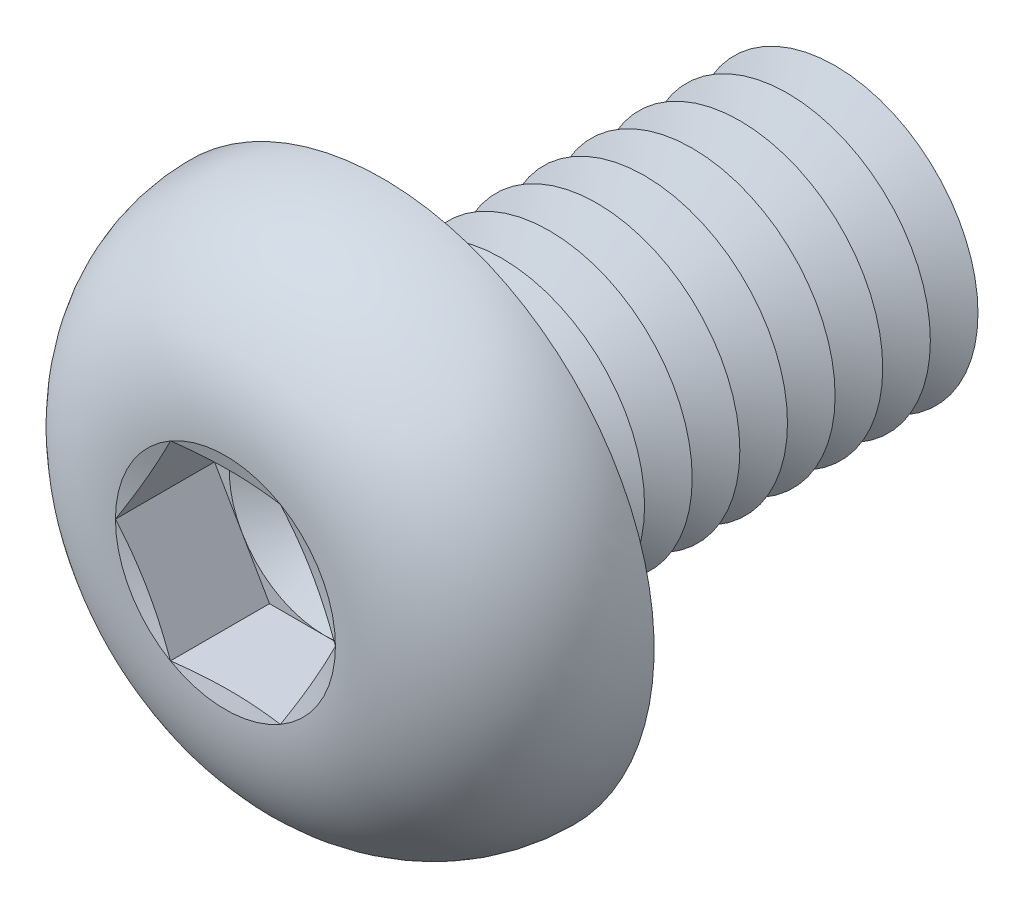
from build123d import *

# Parameters (mm, degrees)
FILLET1_R          = 0.25
LPATTERN1_COUNT    = 10
LPATTERN1_PITCH    = 0.5
CUT_EXTRUDE1_DEPTH = 1.04


with BuildPart() as part:
    # Sketch1 → Revolve1 (revolve)
    with BuildSketch(Plane(origin=(0, 0, 0), x_dir=(0, 0, -1), z_dir=(1, 0, 0)), mode=Mode.PRIVATE) as revolve1_sk:
        with BuildLine():
            Line((0, 1.5), (0, 2.85))
            ThreePointArc((0, 2.85), (-1.182850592, 2.35063849), (-1.65, 1.1547))
            Line((-1.65, 1.1547), (-1.495299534, 0.57735))
            Line((-1.495299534, 0.57735), (-1.65, 0.57735))
            Line((-1.65, 0.57735), (-1.65, 0))
            Line((-1.65, 0), (5, 0))
            Line((5, 0), (5, 1.5))
            Line((5, 1.5), (0, 1.5))
        make_face()
    revolve(revolve1_sk.sketch.rotate(Axis((0, 0, -5), (0, 0, 1)), 90), axis=Axis((0, 0, -5), (0, 0, 1)))

    # Fillet1
    fillet1_edges = [part.edges().sort_by_distance(p)[0] for p in [
        (1.5, 0, 0),
    ]]
    fillet(fillet1_edges, radius=FILLET1_R)

    # Sketch2 → Cut-Revolve1 (revolve, cut)
    with BuildSketch(Plane(origin=(0, 0, 0), x_dir=(0, 0, -1), z_dir=(1, 0, 0)), mode=Mode.PRIVATE) as cut_revolve1_sk:
        Polygon((4.75, 1.5), (5.25, 1.5), (5, 1.066987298), align=None)
    cut_revolve1 = revolve(cut_revolve1_sk.sketch.rotate(Axis((0, 0, -5), (0, 0, -1)), 270), axis=Axis((0, 0, -5), (0, 0, -1)), mode=Mode.SUBTRACT)

    # LPattern1: Cut-Revolve1 ×10
    with Locations(*[(0, 0, i * LPATTERN1_PITCH) for i in range(1, LPATTERN1_COUNT)]):
        add(cut_revolve1, mode=Mode.SUBTRACT)

    # Sketch3 → Cut-Extrude1 (cut)
    with BuildSketch(Plane.XY.offset(1.65)):
        Polygon((0.57735, 0.999999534), (-0.57735, 0.999999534), (-1.1547, 0), (-0.57735, -0.999999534), (0.57735, -0.999999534), (1.1547, 0), align=None)
    extrude(amount=-CUT_EXTRUDE1_DEPTH, mode=Mode.SUBTRACT)

    # Cut-Extrude2 cone 1 section (on through the dimple's axis) → Cut-Extrude2 (revolve, cut)
    with BuildSketch(Plane(origin=(0, 0, 0.61), x_dir=(0, -1, 0), z_dir=(1, 0, 0))):
        Polygon((0, 0), (0.999999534, 0), (0, 0.57735), align=None)
    revolve(axis=Axis((0, 0, 0.61), (0, 0, -1)), mode=Mode.SUBTRACT)


solid = part.part
